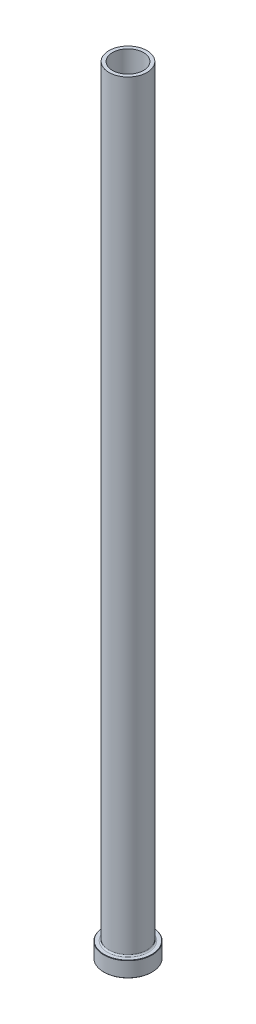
ISO-10303-21;
HEADER;
FILE_DESCRIPTION(('STEP AP214'),'2;1');
FILE_NAME('part.step','',(''),(''),'','','');
FILE_SCHEMA(('AUTOMOTIVE_DESIGN { 1 0 10303 214 1 1 1 1 }'));
ENDSEC;
DATA;
#1=APPLICATION_CONTEXT('core data for automotive mechanical design processes');
#2=APPLICATION_PROTOCOL_DEFINITION('international standard','automotive_design',2000,#1);
#3=PRODUCT_CONTEXT('',#1,'mechanical');
#4=PRODUCT('Part','Part','',(#3));
#5=PRODUCT_RELATED_PRODUCT_CATEGORY('part','',(#4));
#6=PRODUCT_DEFINITION_FORMATION('','',#4);
#7=PRODUCT_DEFINITION_CONTEXT('part definition',#1,'design');
#8=PRODUCT_DEFINITION('design','',#6,#7);
#9=PRODUCT_DEFINITION_SHAPE('','',#8);
#10=(LENGTH_UNIT() NAMED_UNIT(*) SI_UNIT(.MILLI.,.METRE.));
#11=(NAMED_UNIT(*) PLANE_ANGLE_UNIT() SI_UNIT($,.RADIAN.));
#12=(NAMED_UNIT(*) SI_UNIT($,.STERADIAN.) SOLID_ANGLE_UNIT());
#13=UNCERTAINTY_MEASURE_WITH_UNIT(LENGTH_MEASURE(1.E-05),#10,'distance_accuracy_value','');
#14=(GEOMETRIC_REPRESENTATION_CONTEXT(3) GLOBAL_UNCERTAINTY_ASSIGNED_CONTEXT((#13)) GLOBAL_UNIT_ASSIGNED_CONTEXT((#10,
#11,#12)) REPRESENTATION_CONTEXT('',''));
#15=CARTESIAN_POINT('',(0.,0.,0.));
#16=DIRECTION('',(0.,0.,1.));
#17=DIRECTION('',(1.,0.,0.));
#18=AXIS2_PLACEMENT_3D('',#15,#16,#17);
#19=CARTESIAN_POINT('',(0.,92.1876809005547,0.));
#20=DIRECTION('',(0.,1.,0.));
#21=DIRECTION('',(0.,0.,1.));
#22=AXIS2_PLACEMENT_3D('',#19,#20,#21);
#23=CYLINDRICAL_SURFACE('',#22,9.00000000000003);
#24=CARTESIAN_POINT('',(0.,450.,0.));
#25=DIRECTION('',(0.,1.,0.));
#26=DIRECTION('',(0.,0.,1.));
#27=AXIS2_PLACEMENT_3D('',#24,#25,#26);
#28=CIRCLE('',#27,9.00000000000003);
#29=CARTESIAN_POINT('',(0.,450.,9.00000000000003));
#30=VERTEX_POINT('',#29);
#31=EDGE_CURVE('E62',#30,#30,#28,.T.);
#32=ORIENTED_EDGE('',*,*,#31,.T.);
#33=EDGE_LOOP('',(#32));
#34=FACE_BOUND('',#33,.T.);
#35=CARTESIAN_POINT('',(0.,395.,0.));
#36=DIRECTION('',(0.,1.,0.));
#37=DIRECTION('',(0.,0.,1.));
#38=AXIS2_PLACEMENT_3D('',#35,#36,#37);
#39=CIRCLE('',#38,9.00000000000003);
#40=CARTESIAN_POINT('',(0.,395.,9.00000000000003));
#41=VERTEX_POINT('',#40);
#42=EDGE_CURVE('E71',#41,#41,#39,.T.);
#43=ORIENTED_EDGE('',*,*,#42,.F.);
#44=EDGE_LOOP('',(#43));
#45=FACE_BOUND('',#44,.T.);
#46=ADVANCED_FACE('F30',(#34,#45),#23,.F.);
#47=CARTESIAN_POINT('',(-9.00000000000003,450.,0.));
#48=DIRECTION('',(0.,1.,0.));
#49=DIRECTION('',(0.,0.,1.));
#50=AXIS2_PLACEMENT_3D('',#47,#48,#49);
#51=PLANE('',#50);
#52=CARTESIAN_POINT('',(0.,450.,0.));
#53=DIRECTION('',(0.,1.,0.));
#54=DIRECTION('',(0.,0.,1.));
#55=AXIS2_PLACEMENT_3D('',#52,#53,#54);
#56=CIRCLE('',#55,11.);
#57=CARTESIAN_POINT('',(0.,450.,11.));
#58=VERTEX_POINT('',#57);
#59=EDGE_CURVE('E65',#58,#58,#56,.T.);
#60=ORIENTED_EDGE('',*,*,#59,.T.);
#61=EDGE_LOOP('',(#60));
#62=FACE_BOUND('',#61,.T.);
#63=ORIENTED_EDGE('',*,*,#31,.F.);
#64=EDGE_LOOP('',(#63));
#65=FACE_BOUND('',#64,.T.);
#66=ADVANCED_FACE('F79',(#62,#65),#51,.T.);
#67=CARTESIAN_POINT('',(0.,92.1876809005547,0.));
#68=DIRECTION('',(0.,1.,0.));
#69=DIRECTION('',(0.,0.,1.));
#70=AXIS2_PLACEMENT_3D('',#67,#68,#69);
#71=CYLINDRICAL_SURFACE('',#70,11.);
#72=CARTESIAN_POINT('',(0.,9.8,0.));
#73=DIRECTION('',(0.,1.,0.));
#74=DIRECTION('',(0.,0.,1.));
#75=AXIS2_PLACEMENT_3D('',#72,#73,#74);
#76=CIRCLE('',#75,11.);
#77=CARTESIAN_POINT('',(0.,9.8,11.));
#78=VERTEX_POINT('',#77);
#79=EDGE_CURVE('E59',#78,#78,#76,.T.);
#80=ORIENTED_EDGE('',*,*,#79,.T.);
#81=EDGE_LOOP('',(#80));
#82=FACE_BOUND('',#81,.T.);
#83=ORIENTED_EDGE('',*,*,#59,.F.);
#84=EDGE_LOOP('',(#83));
#85=FACE_BOUND('',#84,.T.);
#86=ADVANCED_FACE('F85',(#82,#85),#71,.T.);
#87=CARTESIAN_POINT('',(-11.,9.,0.));
#88=DIRECTION('',(0.,1.,0.));
#89=DIRECTION('',(0.,0.,1.));
#90=AXIS2_PLACEMENT_3D('',#87,#88,#89);
#91=PLANE('',#90);
#92=CARTESIAN_POINT('',(0.,9.,0.));
#93=DIRECTION('',(0.,1.,0.));
#94=DIRECTION('',(0.,0.,1.));
#95=AXIS2_PLACEMENT_3D('',#92,#93,#94);
#96=CIRCLE('',#95,13.7999999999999);
#97=CARTESIAN_POINT('',(0.,9.,13.7999999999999));
#98=VERTEX_POINT('',#97);
#99=EDGE_CURVE('E53',#98,#98,#96,.T.);
#100=ORIENTED_EDGE('',*,*,#99,.T.);
#101=EDGE_LOOP('',(#100));
#102=FACE_BOUND('',#101,.T.);
#103=CARTESIAN_POINT('',(0.,9.,0.));
#104=DIRECTION('',(0.,1.,0.));
#105=DIRECTION('',(0.,0.,1.));
#106=AXIS2_PLACEMENT_3D('',#103,#104,#105);
#107=CIRCLE('',#106,11.8);
#108=CARTESIAN_POINT('',(0.,9.,11.8));
#109=VERTEX_POINT('',#108);
#110=EDGE_CURVE('E56',#109,#109,#107,.F.);
#111=ORIENTED_EDGE('',*,*,#110,.T.);
#112=EDGE_LOOP('',(#111));
#113=FACE_BOUND('',#112,.T.);
#114=ADVANCED_FACE('F111',(#102,#113),#91,.T.);
#115=CARTESIAN_POINT('',(0.,92.1876809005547,0.));
#116=DIRECTION('',(0.,1.,0.));
#117=DIRECTION('',(0.,0.,1.));
#118=AXIS2_PLACEMENT_3D('',#115,#116,#117);
#119=CYLINDRICAL_SURFACE('',#118,14.);
#120=CARTESIAN_POINT('',(0.,8.79999999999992,0.));
#121=DIRECTION('',(0.,1.,0.));
#122=DIRECTION('',(0.,0.,1.));
#123=AXIS2_PLACEMENT_3D('',#120,#121,#122);
#124=CIRCLE('',#123,14.);
#125=CARTESIAN_POINT('',(0.,8.79999999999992,14.));
#126=VERTEX_POINT('',#125);
#127=EDGE_CURVE('E45',#126,#126,#124,.F.);
#128=ORIENTED_EDGE('',*,*,#127,.T.);
#129=EDGE_LOOP('',(#128));
#130=FACE_BOUND('',#129,.T.);
#131=CARTESIAN_POINT('',(0.,0.199999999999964,0.));
#132=DIRECTION('',(0.,-1.,0.));
#133=DIRECTION('',(0.,0.,-1.));
#134=AXIS2_PLACEMENT_3D('',#131,#132,#133);
#135=CIRCLE('',#134,14.);
#136=CARTESIAN_POINT('',(0.,0.199999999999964,-14.));
#137=VERTEX_POINT('',#136);
#138=EDGE_CURVE('E50',#137,#137,#135,.F.);
#139=ORIENTED_EDGE('',*,*,#138,.T.);
#140=EDGE_LOOP('',(#139));
#141=FACE_BOUND('',#140,.T.);
#142=ADVANCED_FACE('F108',(#130,#141),#119,.T.);
#143=CARTESIAN_POINT('',(-14.,0.,0.));
#144=DIRECTION('',(0.,-1.,0.));
#145=DIRECTION('',(0.,0.,-1.));
#146=AXIS2_PLACEMENT_3D('',#143,#144,#145);
#147=PLANE('',#146);
#148=CARTESIAN_POINT('',(0.,0.,0.));
#149=DIRECTION('',(0.,-1.,0.));
#150=DIRECTION('',(0.,0.,-1.));
#151=AXIS2_PLACEMENT_3D('',#148,#149,#150);
#152=CIRCLE('',#151,9.75000000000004);
#153=CARTESIAN_POINT('',(0.,0.,-9.75000000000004));
#154=VERTEX_POINT('',#153);
#155=EDGE_CURVE('E37',#154,#154,#152,.F.);
#156=ORIENTED_EDGE('',*,*,#155,.T.);
#157=EDGE_LOOP('',(#156));
#158=FACE_BOUND('',#157,.T.);
#159=CARTESIAN_POINT('',(0.,0.,0.));
#160=DIRECTION('',(0.,-1.,0.));
#161=DIRECTION('',(0.,0.,-1.));
#162=AXIS2_PLACEMENT_3D('',#159,#160,#161);
#163=CIRCLE('',#162,13.8);
#164=CARTESIAN_POINT('',(0.,0.,-13.8));
#165=VERTEX_POINT('',#164);
#166=EDGE_CURVE('E41',#165,#165,#163,.T.);
#167=ORIENTED_EDGE('',*,*,#166,.T.);
#168=EDGE_LOOP('',(#167));
#169=FACE_BOUND('',#168,.T.);
#170=ADVANCED_FACE('F110',(#158,#169),#147,.T.);
#171=CARTESIAN_POINT('',(0.,92.1876809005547,0.));
#172=DIRECTION('',(0.,1.,0.));
#173=DIRECTION('',(0.,0.,1.));
#174=AXIS2_PLACEMENT_3D('',#171,#172,#173);
#175=CYLINDRICAL_SURFACE('',#174,9.25000000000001);
#176=CARTESIAN_POINT('',(0.,0.499999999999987,0.));
#177=DIRECTION('',(0.,-1.,0.));
#178=DIRECTION('',(0.,0.,-1.));
#179=AXIS2_PLACEMENT_3D('',#176,#177,#178);
#180=CIRCLE('',#179,9.25000000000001);
#181=CARTESIAN_POINT('',(0.,0.499999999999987,-9.25000000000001));
#182=VERTEX_POINT('',#181);
#183=EDGE_CURVE('E10',#182,#182,#180,.T.);
#184=ORIENTED_EDGE('',*,*,#183,.T.);
#185=EDGE_LOOP('',(#184));
#186=FACE_BOUND('',#185,.T.);
#187=CARTESIAN_POINT('',(0.,383.,0.));
#188=DIRECTION('',(0.,1.,0.));
#189=DIRECTION('',(0.,0.,1.));
#190=AXIS2_PLACEMENT_3D('',#187,#188,#189);
#191=CIRCLE('',#190,9.25000000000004);
#192=CARTESIAN_POINT('',(0.,383.,9.25000000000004));
#193=VERTEX_POINT('',#192);
#194=EDGE_CURVE('E68',#193,#193,#191,.T.);
#195=ORIENTED_EDGE('',*,*,#194,.T.);
#196=EDGE_LOOP('',(#195));
#197=FACE_BOUND('',#196,.T.);
#198=ADVANCED_FACE('F118',(#186,#197),#175,.F.);
#199=CARTESIAN_POINT('',(0.,383.,0.));
#200=DIRECTION('',(0.,-1.,0.));
#201=DIRECTION('',(0.,0.,-1.));
#202=AXIS2_PLACEMENT_3D('',#199,#200,#201);
#203=CONICAL_SURFACE('',#202,9.25000000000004,0.0208303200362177);
#204=ORIENTED_EDGE('',*,*,#42,.T.);
#205=EDGE_LOOP('',(#204));
#206=FACE_BOUND('',#205,.T.);
#207=ORIENTED_EDGE('',*,*,#194,.F.);
#208=EDGE_LOOP('',(#207));
#209=FACE_BOUND('',#208,.T.);
#210=ADVANCED_FACE('F75',(#206,#209),#203,.F.);
#211=CARTESIAN_POINT('',(0.,9.8,0.));
#212=DIRECTION('',(0.,1.,0.));
#213=DIRECTION('',(0.,0.,1.));
#214=AXIS2_PLACEMENT_3D('',#211,#212,#213);
#215=TOROIDAL_SURFACE('',#214,11.8,0.8);
#216=ORIENTED_EDGE('',*,*,#110,.F.);
#217=EDGE_LOOP('',(#216));
#218=FACE_BOUND('',#217,.T.);
#219=ORIENTED_EDGE('',*,*,#79,.F.);
#220=EDGE_LOOP('',(#219));
#221=FACE_BOUND('',#220,.T.);
#222=ADVANCED_FACE('F90',(#218,#221),#215,.F.);
#223=CARTESIAN_POINT('',(0.,8.99999999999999,0.));
#224=DIRECTION('',(0.,-1.,0.));
#225=DIRECTION('',(0.,0.,-1.));
#226=AXIS2_PLACEMENT_3D('',#223,#224,#225);
#227=CONICAL_SURFACE('',#226,13.7999999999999,0.785398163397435);
#228=ORIENTED_EDGE('',*,*,#127,.F.);
#229=EDGE_LOOP('',(#228));
#230=FACE_BOUND('',#229,.T.);
#231=ORIENTED_EDGE('',*,*,#99,.F.);
#232=EDGE_LOOP('',(#231));
#233=FACE_BOUND('',#232,.T.);
#234=ADVANCED_FACE('F93',(#230,#233),#227,.T.);
#235=CARTESIAN_POINT('',(0.,0.199999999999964,0.));
#236=DIRECTION('',(0.,1.,0.));
#237=DIRECTION('',(0.,0.,1.));
#238=AXIS2_PLACEMENT_3D('',#235,#236,#237);
#239=CONICAL_SURFACE('',#238,14.,0.785398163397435);
#240=ORIENTED_EDGE('',*,*,#166,.F.);
#241=EDGE_LOOP('',(#240));
#242=FACE_BOUND('',#241,.T.);
#243=ORIENTED_EDGE('',*,*,#138,.F.);
#244=EDGE_LOOP('',(#243));
#245=FACE_BOUND('',#244,.T.);
#246=ADVANCED_FACE('F96',(#242,#245),#239,.T.);
#247=CARTESIAN_POINT('',(0.,0.,0.));
#248=DIRECTION('',(0.,-1.,0.));
#249=DIRECTION('',(0.,0.,-1.));
#250=AXIS2_PLACEMENT_3D('',#247,#248,#249);
#251=CONICAL_SURFACE('',#250,9.75000000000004,0.785398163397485);
#252=ORIENTED_EDGE('',*,*,#183,.F.);
#253=EDGE_LOOP('',(#252));
#254=FACE_BOUND('',#253,.T.);
#255=ORIENTED_EDGE('',*,*,#155,.F.);
#256=EDGE_LOOP('',(#255));
#257=FACE_BOUND('',#256,.T.);
#258=ADVANCED_FACE('F32',(#254,#257),#251,.F.);
#259=CLOSED_SHELL('',(#46,#66,#86,#114,#142,#170,#198,#210,#222,#234,#246,#258));
#260=MANIFOLD_SOLID_BREP('B2',#259);
#261=ADVANCED_BREP_SHAPE_REPRESENTATION('',(#18,#260),#14);
#262=SHAPE_DEFINITION_REPRESENTATION(#9,#261);
ENDSEC;
END-ISO-10303-21;
